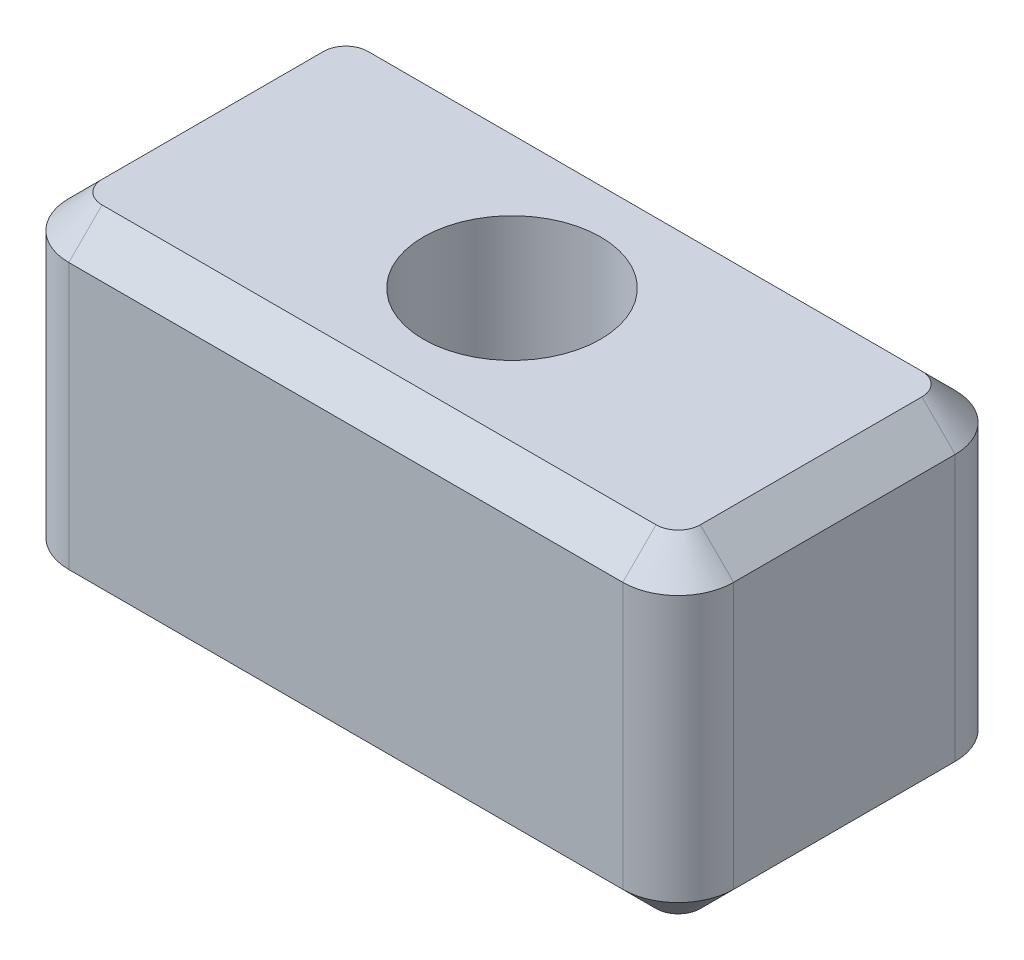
ISO-10303-21;
HEADER;
FILE_DESCRIPTION(('STEP AP214'),'2;1');
FILE_NAME('part.step','',(''),(''),'','','');
FILE_SCHEMA(('AUTOMOTIVE_DESIGN { 1 0 10303 214 1 1 1 1 }'));
ENDSEC;
DATA;
#1=APPLICATION_CONTEXT('core data for automotive mechanical design processes');
#2=APPLICATION_PROTOCOL_DEFINITION('international standard','automotive_design',2000,#1);
#3=PRODUCT_CONTEXT('',#1,'mechanical');
#4=PRODUCT('Part','Part','',(#3));
#5=PRODUCT_RELATED_PRODUCT_CATEGORY('part','',(#4));
#6=PRODUCT_DEFINITION_FORMATION('','',#4);
#7=PRODUCT_DEFINITION_CONTEXT('part definition',#1,'design');
#8=PRODUCT_DEFINITION('design','',#6,#7);
#9=PRODUCT_DEFINITION_SHAPE('','',#8);
#10=(LENGTH_UNIT() NAMED_UNIT(*) SI_UNIT(.MILLI.,.METRE.));
#11=(NAMED_UNIT(*) PLANE_ANGLE_UNIT() SI_UNIT($,.RADIAN.));
#12=(NAMED_UNIT(*) SI_UNIT($,.STERADIAN.) SOLID_ANGLE_UNIT());
#13=UNCERTAINTY_MEASURE_WITH_UNIT(LENGTH_MEASURE(1.E-05),#10,'distance_accuracy_value','');
#14=(GEOMETRIC_REPRESENTATION_CONTEXT(3) GLOBAL_UNCERTAINTY_ASSIGNED_CONTEXT((#13)) GLOBAL_UNIT_ASSIGNED_CONTEXT((#10,
#11,#12)) REPRESENTATION_CONTEXT('',''));
#15=CARTESIAN_POINT('',(0.,0.,0.));
#16=DIRECTION('',(0.,0.,1.));
#17=DIRECTION('',(1.,0.,0.));
#18=AXIS2_PLACEMENT_3D('',#15,#16,#17);
#19=CARTESIAN_POINT('',(53.,-5.4,0.15));
#20=DIRECTION('',(-1.,0.,0.));
#21=DIRECTION('',(0.,0.,1.));
#22=AXIS2_PLACEMENT_3D('',#19,#20,#21);
#23=PLANE('',#22);
#24=DIRECTION('',(0.,1.,0.));
#25=VECTOR('',#24,1.);
#26=CARTESIAN_POINT('',(53.,-5.4,2.65));
#27=LINE('',#26,#25);
#28=CARTESIAN_POINT('',(53.,-5.1,2.65));
#29=VERTEX_POINT('',#28);
#30=CARTESIAN_POINT('',(53.,-2.7,2.65));
#31=VERTEX_POINT('',#30);
#32=EDGE_CURVE('E320',#29,#31,#27,.T.);
#33=ORIENTED_EDGE('',*,*,#32,.T.);
#34=DIRECTION('',(0.,0.,-1.));
#35=VECTOR('',#34,1.);
#36=CARTESIAN_POINT('',(53.,-2.7,0.15));
#37=LINE('',#36,#35);
#38=CARTESIAN_POINT('',(53.,-2.7,0.65));
#39=VERTEX_POINT('',#38);
#40=EDGE_CURVE('E293',#31,#39,#37,.T.);
#41=ORIENTED_EDGE('',*,*,#40,.T.);
#42=DIRECTION('',(0.,1.,0.));
#43=VECTOR('',#42,1.);
#44=CARTESIAN_POINT('',(53.,-5.4,0.65));
#45=LINE('',#44,#43);
#46=CARTESIAN_POINT('',(53.,-5.1,0.65));
#47=VERTEX_POINT('',#46);
#48=EDGE_CURVE('E318',#39,#47,#45,.F.);
#49=ORIENTED_EDGE('',*,*,#48,.T.);
#50=DIRECTION('',(0.,0.,1.));
#51=VECTOR('',#50,1.);
#52=CARTESIAN_POINT('',(53.,-5.1,2.65));
#53=LINE('',#52,#51);
#54=EDGE_CURVE('E296',#47,#29,#53,.T.);
#55=ORIENTED_EDGE('',*,*,#54,.T.);
#56=EDGE_LOOP('',(#33,#41,#49,#55));
#57=FACE_BOUND('',#56,.T.);
#58=ADVANCED_FACE('F37',(#57),#23,.T.);
#59=CARTESIAN_POINT('',(53.,-5.4,0.15));
#60=DIRECTION('',(0.,0.,-1.));
#61=DIRECTION('',(-1.,0.,0.));
#62=AXIS2_PLACEMENT_3D('',#59,#60,#61);
#63=PLANE('',#62);
#64=DIRECTION('',(0.,1.,0.));
#65=VECTOR('',#64,1.);
#66=CARTESIAN_POINT('',(53.5,-5.4,0.15));
#67=LINE('',#66,#65);
#68=CARTESIAN_POINT('',(53.5,-5.1,0.15));
#69=VERTEX_POINT('',#68);
#70=CARTESIAN_POINT('',(53.5,-2.7,0.15));
#71=VERTEX_POINT('',#70);
#72=EDGE_CURVE('E323',#69,#71,#67,.T.);
#73=ORIENTED_EDGE('',*,*,#72,.T.);
#74=DIRECTION('',(1.,0.,0.));
#75=VECTOR('',#74,1.);
#76=CARTESIAN_POINT('',(53.,-2.7,0.15));
#77=LINE('',#76,#75);
#78=CARTESIAN_POINT('',(58.5,-2.7,0.15));
#79=VERTEX_POINT('',#78);
#80=EDGE_CURVE('E242',#71,#79,#77,.T.);
#81=ORIENTED_EDGE('',*,*,#80,.T.);
#82=DIRECTION('',(0.,1.,0.));
#83=VECTOR('',#82,1.);
#84=CARTESIAN_POINT('',(58.5,-5.4,0.15));
#85=LINE('',#84,#83);
#86=CARTESIAN_POINT('',(58.5,-5.1,0.15));
#87=VERTEX_POINT('',#86);
#88=EDGE_CURVE('E326',#79,#87,#85,.F.);
#89=ORIENTED_EDGE('',*,*,#88,.T.);
#90=DIRECTION('',(-1.,0.,0.));
#91=VECTOR('',#90,1.);
#92=CARTESIAN_POINT('',(53.5,-5.1,0.15));
#93=LINE('',#92,#91);
#94=EDGE_CURVE('E239',#87,#69,#93,.T.);
#95=ORIENTED_EDGE('',*,*,#94,.T.);
#96=EDGE_LOOP('',(#73,#81,#89,#95));
#97=FACE_BOUND('',#96,.T.);
#98=ADVANCED_FACE('F352',(#97),#63,.T.);
#99=CARTESIAN_POINT('',(59.,-5.4,0.15));
#100=DIRECTION('',(1.,0.,0.));
#101=DIRECTION('',(0.,0.,-1.));
#102=AXIS2_PLACEMENT_3D('',#99,#100,#101);
#103=PLANE('',#102);
#104=DIRECTION('',(0.,1.,0.));
#105=VECTOR('',#104,1.);
#106=CARTESIAN_POINT('',(59.,-5.4,0.65));
#107=LINE('',#106,#105);
#108=CARTESIAN_POINT('',(59.,-5.1,0.65));
#109=VERTEX_POINT('',#108);
#110=CARTESIAN_POINT('',(59.,-2.7,0.65));
#111=VERTEX_POINT('',#110);
#112=EDGE_CURVE('E312',#109,#111,#107,.T.);
#113=ORIENTED_EDGE('',*,*,#112,.T.);
#114=DIRECTION('',(0.,0.,1.));
#115=VECTOR('',#114,1.);
#116=CARTESIAN_POINT('',(59.,-2.7,0.15));
#117=LINE('',#116,#115);
#118=CARTESIAN_POINT('',(59.,-2.7,2.65));
#119=VERTEX_POINT('',#118);
#120=EDGE_CURVE('E258',#111,#119,#117,.T.);
#121=ORIENTED_EDGE('',*,*,#120,.T.);
#122=DIRECTION('',(0.,1.,0.));
#123=VECTOR('',#122,1.);
#124=CARTESIAN_POINT('',(59.,-5.4,2.65));
#125=LINE('',#124,#123);
#126=CARTESIAN_POINT('',(59.,-5.1,2.65));
#127=VERTEX_POINT('',#126);
#128=EDGE_CURVE('E315',#119,#127,#125,.F.);
#129=ORIENTED_EDGE('',*,*,#128,.T.);
#130=DIRECTION('',(0.,0.,-1.));
#131=VECTOR('',#130,1.);
#132=CARTESIAN_POINT('',(59.,-5.1,0.65));
#133=LINE('',#132,#131);
#134=EDGE_CURVE('E256',#127,#109,#133,.T.);
#135=ORIENTED_EDGE('',*,*,#134,.T.);
#136=EDGE_LOOP('',(#113,#121,#129,#135));
#137=FACE_BOUND('',#136,.T.);
#138=ADVANCED_FACE('F348',(#137),#103,.T.);
#139=CARTESIAN_POINT('',(53.,-5.4,3.15));
#140=DIRECTION('',(0.,0.,1.));
#141=DIRECTION('',(1.,0.,0.));
#142=AXIS2_PLACEMENT_3D('',#139,#140,#141);
#143=PLANE('',#142);
#144=DIRECTION('',(0.,1.,0.));
#145=VECTOR('',#144,1.);
#146=CARTESIAN_POINT('',(58.5,-5.4,3.15));
#147=LINE('',#146,#145);
#148=CARTESIAN_POINT('',(58.5,-5.1,3.15));
#149=VERTEX_POINT('',#148);
#150=CARTESIAN_POINT('',(58.5,-2.7,3.15));
#151=VERTEX_POINT('',#150);
#152=EDGE_CURVE('E310',#149,#151,#147,.T.);
#153=ORIENTED_EDGE('',*,*,#152,.T.);
#154=DIRECTION('',(-1.,0.,0.));
#155=VECTOR('',#154,1.);
#156=CARTESIAN_POINT('',(53.,-2.7,3.15));
#157=LINE('',#156,#155);
#158=CARTESIAN_POINT('',(53.5,-2.7,3.15));
#159=VERTEX_POINT('',#158);
#160=EDGE_CURVE('E233',#151,#159,#157,.T.);
#161=ORIENTED_EDGE('',*,*,#160,.T.);
#162=DIRECTION('',(0.,1.,0.));
#163=VECTOR('',#162,1.);
#164=CARTESIAN_POINT('',(53.5,-5.4,3.15));
#165=LINE('',#164,#163);
#166=CARTESIAN_POINT('',(53.5,-5.1,3.15));
#167=VERTEX_POINT('',#166);
#168=EDGE_CURVE('E175',#159,#167,#165,.F.);
#169=ORIENTED_EDGE('',*,*,#168,.T.);
#170=DIRECTION('',(1.,0.,0.));
#171=VECTOR('',#170,1.);
#172=CARTESIAN_POINT('',(58.5,-5.1,3.15));
#173=LINE('',#172,#171);
#174=EDGE_CURVE('E240',#167,#149,#173,.T.);
#175=ORIENTED_EDGE('',*,*,#174,.T.);
#176=EDGE_LOOP('',(#153,#161,#169,#175));
#177=FACE_BOUND('',#176,.T.);
#178=ADVANCED_FACE('F340',(#177),#143,.T.);
#179=CARTESIAN_POINT('',(0.,-5.4,0.));
#180=DIRECTION('',(0.,1.,0.));
#181=DIRECTION('',(0.,0.,1.));
#182=AXIS2_PLACEMENT_3D('',#179,#180,#181);
#183=PLANE('',#182);
#184=CARTESIAN_POINT('',(53.5,-5.4,2.65));
#185=DIRECTION('',(0.,1.,0.));
#186=DIRECTION('',(0.,0.,1.));
#187=AXIS2_PLACEMENT_3D('',#184,#185,#186);
#188=CIRCLE('',#187,0.199999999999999);
#189=CARTESIAN_POINT('',(53.5,-5.4,2.85));
#190=VERTEX_POINT('',#189);
#191=CARTESIAN_POINT('',(53.3,-5.4,2.65));
#192=VERTEX_POINT('',#191);
#193=EDGE_CURVE('E46',#190,#192,#188,.F.);
#194=ORIENTED_EDGE('',*,*,#193,.T.);
#195=DIRECTION('',(0.,0.,-1.));
#196=VECTOR('',#195,1.);
#197=CARTESIAN_POINT('',(53.3,-5.4,0.65));
#198=LINE('',#197,#196);
#199=CARTESIAN_POINT('',(53.3,-5.4,0.65));
#200=VERTEX_POINT('',#199);
#201=EDGE_CURVE('E11',#192,#200,#198,.T.);
#202=ORIENTED_EDGE('',*,*,#201,.T.);
#203=CARTESIAN_POINT('',(53.5,-5.4,0.65));
#204=DIRECTION('',(0.,1.,0.));
#205=DIRECTION('',(0.,0.,1.));
#206=AXIS2_PLACEMENT_3D('',#203,#204,#205);
#207=CIRCLE('',#206,0.199999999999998);
#208=CARTESIAN_POINT('',(53.5,-5.4,0.450000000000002));
#209=VERTEX_POINT('',#208);
#210=EDGE_CURVE('E270',#200,#209,#207,.F.);
#211=ORIENTED_EDGE('',*,*,#210,.T.);
#212=DIRECTION('',(1.,0.,0.));
#213=VECTOR('',#212,1.);
#214=CARTESIAN_POINT('',(58.5,-5.4,0.450000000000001));
#215=LINE('',#214,#213);
#216=CARTESIAN_POINT('',(58.5,-5.4,0.450000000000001));
#217=VERTEX_POINT('',#216);
#218=EDGE_CURVE('E266',#209,#217,#215,.T.);
#219=ORIENTED_EDGE('',*,*,#218,.T.);
#220=CARTESIAN_POINT('',(58.5,-5.4,0.65));
#221=DIRECTION('',(0.,1.,0.));
#222=DIRECTION('',(0.,0.,1.));
#223=AXIS2_PLACEMENT_3D('',#220,#221,#222);
#224=CIRCLE('',#223,0.199999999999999);
#225=CARTESIAN_POINT('',(58.7,-5.4,0.65));
#226=VERTEX_POINT('',#225);
#227=EDGE_CURVE('E262',#217,#226,#224,.F.);
#228=ORIENTED_EDGE('',*,*,#227,.T.);
#229=DIRECTION('',(0.,0.,1.));
#230=VECTOR('',#229,1.);
#231=CARTESIAN_POINT('',(58.7,-5.4,2.65));
#232=LINE('',#231,#230);
#233=CARTESIAN_POINT('',(58.7,-5.4,2.65));
#234=VERTEX_POINT('',#233);
#235=EDGE_CURVE('E260',#226,#234,#232,.T.);
#236=ORIENTED_EDGE('',*,*,#235,.T.);
#237=CARTESIAN_POINT('',(58.5,-5.4,2.65));
#238=DIRECTION('',(0.,1.,0.));
#239=DIRECTION('',(0.,0.,1.));
#240=AXIS2_PLACEMENT_3D('',#237,#238,#239);
#241=CIRCLE('',#240,0.199999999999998);
#242=CARTESIAN_POINT('',(58.5,-5.4,2.85));
#243=VERTEX_POINT('',#242);
#244=EDGE_CURVE('E264',#234,#243,#241,.F.);
#245=ORIENTED_EDGE('',*,*,#244,.T.);
#246=DIRECTION('',(-1.,0.,0.));
#247=VECTOR('',#246,1.);
#248=CARTESIAN_POINT('',(53.5,-5.4,2.85));
#249=LINE('',#248,#247);
#250=EDGE_CURVE('E268',#243,#190,#249,.T.);
#251=ORIENTED_EDGE('',*,*,#250,.T.);
#252=EDGE_LOOP('',(#194,#202,#211,#219,#228,#236,#245,#251));
#253=FACE_BOUND('',#252,.T.);
#254=CARTESIAN_POINT('',(56.,-5.4,1.65));
#255=DIRECTION('',(0.,-1.,0.));
#256=DIRECTION('',(0.,0.,-1.));
#257=AXIS2_PLACEMENT_3D('',#254,#255,#256);
#258=CIRCLE('',#257,1.025);
#259=CARTESIAN_POINT('',(56.,-5.4,0.625000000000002));
#260=VERTEX_POINT('',#259);
#261=EDGE_CURVE('E181',#260,#260,#258,.T.);
#262=ORIENTED_EDGE('',*,*,#261,.F.);
#263=EDGE_LOOP('',(#262));
#264=FACE_BOUND('',#263,.T.);
#265=ADVANCED_FACE('F272',(#253,#264),#183,.F.);
#266=CARTESIAN_POINT('',(0.,-2.4,0.));
#267=DIRECTION('',(0.,1.,0.));
#268=DIRECTION('',(0.,0.,1.));
#269=AXIS2_PLACEMENT_3D('',#266,#267,#268);
#270=PLANE('',#269);
#271=CARTESIAN_POINT('',(53.5,-2.4,0.65));
#272=DIRECTION('',(0.,1.,0.));
#273=DIRECTION('',(0.,0.,1.));
#274=AXIS2_PLACEMENT_3D('',#271,#272,#273);
#275=CIRCLE('',#274,0.199999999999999);
#276=CARTESIAN_POINT('',(53.5,-2.4,0.450000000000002));
#277=VERTEX_POINT('',#276);
#278=CARTESIAN_POINT('',(53.3,-2.4,0.65));
#279=VERTEX_POINT('',#278);
#280=EDGE_CURVE('E304',#277,#279,#275,.T.);
#281=ORIENTED_EDGE('',*,*,#280,.T.);
#282=DIRECTION('',(0.,0.,1.));
#283=VECTOR('',#282,1.);
#284=CARTESIAN_POINT('',(53.3,-2.4,0.));
#285=LINE('',#284,#283);
#286=CARTESIAN_POINT('',(53.3,-2.4,2.65));
#287=VERTEX_POINT('',#286);
#288=EDGE_CURVE('E299',#279,#287,#285,.T.);
#289=ORIENTED_EDGE('',*,*,#288,.T.);
#290=CARTESIAN_POINT('',(53.5,-2.4,2.65));
#291=DIRECTION('',(0.,1.,0.));
#292=DIRECTION('',(0.,0.,1.));
#293=AXIS2_PLACEMENT_3D('',#290,#291,#292);
#294=CIRCLE('',#293,0.199999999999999);
#295=CARTESIAN_POINT('',(53.5,-2.4,2.85));
#296=VERTEX_POINT('',#295);
#297=EDGE_CURVE('E302',#287,#296,#294,.T.);
#298=ORIENTED_EDGE('',*,*,#297,.T.);
#299=DIRECTION('',(1.,0.,0.));
#300=VECTOR('',#299,1.);
#301=CARTESIAN_POINT('',(0.,-2.4,2.85));
#302=LINE('',#301,#300);
#303=CARTESIAN_POINT('',(58.5,-2.4,2.85));
#304=VERTEX_POINT('',#303);
#305=EDGE_CURVE('E158',#296,#304,#302,.T.);
#306=ORIENTED_EDGE('',*,*,#305,.T.);
#307=CARTESIAN_POINT('',(58.5,-2.4,2.65));
#308=DIRECTION('',(0.,1.,0.));
#309=DIRECTION('',(0.,0.,1.));
#310=AXIS2_PLACEMENT_3D('',#307,#308,#309);
#311=CIRCLE('',#310,0.199999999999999);
#312=CARTESIAN_POINT('',(58.7,-2.4,2.65));
#313=VERTEX_POINT('',#312);
#314=EDGE_CURVE('E151',#304,#313,#311,.T.);
#315=ORIENTED_EDGE('',*,*,#314,.T.);
#316=DIRECTION('',(0.,0.,-1.));
#317=VECTOR('',#316,1.);
#318=CARTESIAN_POINT('',(58.7,-2.4,0.));
#319=LINE('',#318,#317);
#320=CARTESIAN_POINT('',(58.7,-2.4,0.65));
#321=VERTEX_POINT('',#320);
#322=EDGE_CURVE('E155',#313,#321,#319,.T.);
#323=ORIENTED_EDGE('',*,*,#322,.T.);
#324=CARTESIAN_POINT('',(58.5,-2.4,0.65));
#325=DIRECTION('',(0.,1.,0.));
#326=DIRECTION('',(0.,0.,1.));
#327=AXIS2_PLACEMENT_3D('',#324,#325,#326);
#328=CIRCLE('',#327,0.199999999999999);
#329=CARTESIAN_POINT('',(58.5,-2.4,0.450000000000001));
#330=VERTEX_POINT('',#329);
#331=EDGE_CURVE('E164',#321,#330,#328,.T.);
#332=ORIENTED_EDGE('',*,*,#331,.T.);
#333=DIRECTION('',(-1.,0.,0.));
#334=VECTOR('',#333,1.);
#335=CARTESIAN_POINT('',(0.,-2.4,0.450000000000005));
#336=LINE('',#335,#334);
#337=EDGE_CURVE('E163',#330,#277,#336,.T.);
#338=ORIENTED_EDGE('',*,*,#337,.T.);
#339=EDGE_LOOP('',(#281,#289,#298,#306,#315,#323,#332,#338));
#340=FACE_BOUND('',#339,.T.);
#341=CARTESIAN_POINT('',(56.,-2.39999999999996,1.65));
#342=DIRECTION('',(0.,-1.,0.));
#343=DIRECTION('',(0.,0.,-1.));
#344=AXIS2_PLACEMENT_3D('',#341,#342,#343);
#345=CIRCLE('',#344,0.800000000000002);
#346=CARTESIAN_POINT('',(56.,-2.39999999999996,0.849999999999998));
#347=VERTEX_POINT('',#346);
#348=EDGE_CURVE('E329',#347,#347,#345,.T.);
#349=ORIENTED_EDGE('',*,*,#348,.T.);
#350=EDGE_LOOP('',(#349));
#351=FACE_BOUND('',#350,.T.);
#352=ADVANCED_FACE('F153',(#340,#351),#270,.T.);
#353=CARTESIAN_POINT('',(56.,-5.4,1.65));
#354=DIRECTION('',(0.,-1.,0.));
#355=DIRECTION('',(0.,0.,-1.));
#356=AXIS2_PLACEMENT_3D('',#353,#354,#355);
#357=CYLINDRICAL_SURFACE('',#356,0.800000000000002);
#358=ORIENTED_EDGE('',*,*,#348,.F.);
#359=EDGE_LOOP('',(#358));
#360=FACE_BOUND('',#359,.T.);
#361=CARTESIAN_POINT('',(56.,-5.175,1.65));
#362=DIRECTION('',(0.,-1.,0.));
#363=DIRECTION('',(0.,0.,-1.));
#364=AXIS2_PLACEMENT_3D('',#361,#362,#363);
#365=CIRCLE('',#364,0.800000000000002);
#366=CARTESIAN_POINT('',(56.,-5.175,0.849999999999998));
#367=VERTEX_POINT('',#366);
#368=EDGE_CURVE('E332',#367,#367,#365,.T.);
#369=ORIENTED_EDGE('',*,*,#368,.T.);
#370=EDGE_LOOP('',(#369));
#371=FACE_BOUND('',#370,.T.);
#372=ADVANCED_FACE('F346',(#360,#371),#357,.F.);
#373=CARTESIAN_POINT('',(56.,-5.4,1.65));
#374=DIRECTION('',(0.,-1.,0.));
#375=DIRECTION('',(0.,0.,-1.));
#376=AXIS2_PLACEMENT_3D('',#373,#374,#375);
#377=CONICAL_SURFACE('',#376,1.025,0.785398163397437);
#378=ORIENTED_EDGE('',*,*,#368,.F.);
#379=EDGE_LOOP('',(#378));
#380=FACE_BOUND('',#379,.T.);
#381=ORIENTED_EDGE('',*,*,#261,.T.);
#382=EDGE_LOOP('',(#381));
#383=FACE_BOUND('',#382,.T.);
#384=ADVANCED_FACE('F338',(#380,#383),#377,.F.);
#385=CARTESIAN_POINT('',(53.5,-5.4,0.65));
#386=DIRECTION('',(0.,1.,0.));
#387=DIRECTION('',(0.,0.,1.));
#388=AXIS2_PLACEMENT_3D('',#385,#386,#387);
#389=CYLINDRICAL_SURFACE('',#388,0.5);
#390=ORIENTED_EDGE('',*,*,#48,.F.);
#391=CARTESIAN_POINT('',(53.5,-2.7,0.65));
#392=DIRECTION('',(0.,1.,0.));
#393=DIRECTION('',(0.,0.,1.));
#394=AXIS2_PLACEMENT_3D('',#391,#392,#393);
#395=CIRCLE('',#394,0.5);
#396=EDGE_CURVE('E244',#39,#71,#395,.F.);
#397=ORIENTED_EDGE('',*,*,#396,.T.);
#398=ORIENTED_EDGE('',*,*,#72,.F.);
#399=CARTESIAN_POINT('',(53.5,-5.1,0.65));
#400=DIRECTION('',(0.,1.,0.));
#401=DIRECTION('',(0.,0.,1.));
#402=AXIS2_PLACEMENT_3D('',#399,#400,#401);
#403=CIRCLE('',#402,0.5);
#404=EDGE_CURVE('E282',#69,#47,#403,.T.);
#405=ORIENTED_EDGE('',*,*,#404,.T.);
#406=EDGE_LOOP('',(#390,#397,#398,#405));
#407=FACE_BOUND('',#406,.T.);
#408=ADVANCED_FACE('F362',(#407),#389,.T.);
#409=CARTESIAN_POINT('',(58.5,-5.4,0.65));
#410=DIRECTION('',(0.,1.,0.));
#411=DIRECTION('',(0.,0.,1.));
#412=AXIS2_PLACEMENT_3D('',#409,#410,#411);
#413=CYLINDRICAL_SURFACE('',#412,0.5);
#414=ORIENTED_EDGE('',*,*,#88,.F.);
#415=CARTESIAN_POINT('',(58.5,-2.7,0.65));
#416=DIRECTION('',(0.,1.,0.));
#417=DIRECTION('',(0.,0.,1.));
#418=AXIS2_PLACEMENT_3D('',#415,#416,#417);
#419=CIRCLE('',#418,0.5);
#420=EDGE_CURVE('E254',#79,#111,#419,.F.);
#421=ORIENTED_EDGE('',*,*,#420,.T.);
#422=ORIENTED_EDGE('',*,*,#112,.F.);
#423=CARTESIAN_POINT('',(58.5,-5.1,0.65));
#424=DIRECTION('',(0.,1.,0.));
#425=DIRECTION('',(0.,0.,1.));
#426=AXIS2_PLACEMENT_3D('',#423,#424,#425);
#427=CIRCLE('',#426,0.5);
#428=EDGE_CURVE('E252',#109,#87,#427,.T.);
#429=ORIENTED_EDGE('',*,*,#428,.T.);
#430=EDGE_LOOP('',(#414,#421,#422,#429));
#431=FACE_BOUND('',#430,.T.);
#432=ADVANCED_FACE('F365',(#431),#413,.T.);
#433=CARTESIAN_POINT('',(53.5,-5.4,2.65));
#434=DIRECTION('',(0.,1.,0.));
#435=DIRECTION('',(0.,0.,1.));
#436=AXIS2_PLACEMENT_3D('',#433,#434,#435);
#437=CYLINDRICAL_SURFACE('',#436,0.5);
#438=ORIENTED_EDGE('',*,*,#168,.F.);
#439=CARTESIAN_POINT('',(53.5,-2.7,2.65));
#440=DIRECTION('',(0.,1.,0.));
#441=DIRECTION('',(0.,0.,1.));
#442=AXIS2_PLACEMENT_3D('',#439,#440,#441);
#443=CIRCLE('',#442,0.5);
#444=EDGE_CURVE('E287',#159,#31,#443,.F.);
#445=ORIENTED_EDGE('',*,*,#444,.T.);
#446=ORIENTED_EDGE('',*,*,#32,.F.);
#447=CARTESIAN_POINT('',(53.5,-5.1,2.65));
#448=DIRECTION('',(0.,1.,0.));
#449=DIRECTION('',(0.,0.,1.));
#450=AXIS2_PLACEMENT_3D('',#447,#448,#449);
#451=CIRCLE('',#450,0.5);
#452=EDGE_CURVE('E289',#29,#167,#451,.T.);
#453=ORIENTED_EDGE('',*,*,#452,.T.);
#454=EDGE_LOOP('',(#438,#445,#446,#453));
#455=FACE_BOUND('',#454,.T.);
#456=ADVANCED_FACE('F368',(#455),#437,.T.);
#457=CARTESIAN_POINT('',(58.5,-5.4,2.65));
#458=DIRECTION('',(0.,1.,0.));
#459=DIRECTION('',(0.,0.,1.));
#460=AXIS2_PLACEMENT_3D('',#457,#458,#459);
#461=CYLINDRICAL_SURFACE('',#460,0.5);
#462=ORIENTED_EDGE('',*,*,#128,.F.);
#463=CARTESIAN_POINT('',(58.5,-2.7,2.65));
#464=DIRECTION('',(0.,1.,0.));
#465=DIRECTION('',(0.,0.,1.));
#466=AXIS2_PLACEMENT_3D('',#463,#464,#465);
#467=CIRCLE('',#466,0.5);
#468=EDGE_CURVE('E178',#119,#151,#467,.F.);
#469=ORIENTED_EDGE('',*,*,#468,.T.);
#470=ORIENTED_EDGE('',*,*,#152,.F.);
#471=CARTESIAN_POINT('',(58.5,-5.1,2.65));
#472=DIRECTION('',(0.,1.,0.));
#473=DIRECTION('',(0.,0.,1.));
#474=AXIS2_PLACEMENT_3D('',#471,#472,#473);
#475=CIRCLE('',#474,0.5);
#476=EDGE_CURVE('E249',#149,#127,#475,.T.);
#477=ORIENTED_EDGE('',*,*,#476,.T.);
#478=EDGE_LOOP('',(#462,#469,#470,#477));
#479=FACE_BOUND('',#478,.T.);
#480=ADVANCED_FACE('F372',(#479),#461,.T.);
#481=CARTESIAN_POINT('',(58.7,-2.4,0.));
#482=DIRECTION('',(-0.707106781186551,-0.707106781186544,0.));
#483=DIRECTION('',(0.,0.,-1.));
#484=AXIS2_PLACEMENT_3D('',#481,#482,#483);
#485=PLANE('',#484);
#486=DIRECTION('',(-0.707106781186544,0.707106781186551,0.));
#487=VECTOR('',#486,1.);
#488=CARTESIAN_POINT('',(59.,-2.7,2.65));
#489=LINE('',#488,#487);
#490=EDGE_CURVE('E170',#119,#313,#489,.T.);
#491=ORIENTED_EDGE('',*,*,#490,.F.);
#492=ORIENTED_EDGE('',*,*,#120,.F.);
#493=DIRECTION('',(0.707106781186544,-0.707106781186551,0.));
#494=VECTOR('',#493,1.);
#495=CARTESIAN_POINT('',(58.7,-2.4,0.65));
#496=LINE('',#495,#494);
#497=EDGE_CURVE('E173',#321,#111,#496,.T.);
#498=ORIENTED_EDGE('',*,*,#497,.F.);
#499=ORIENTED_EDGE('',*,*,#322,.F.);
#500=EDGE_LOOP('',(#491,#492,#498,#499));
#501=FACE_BOUND('',#500,.T.);
#502=ADVANCED_FACE('F168',(#501),#485,.F.);
#503=CARTESIAN_POINT('',(58.5,-2.4,0.65));
#504=DIRECTION('',(0.,-1.,0.));
#505=DIRECTION('',(0.,0.,-1.));
#506=AXIS2_PLACEMENT_3D('',#503,#504,#505);
#507=CONICAL_SURFACE('',#506,0.199999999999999,0.785398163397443);
#508=ORIENTED_EDGE('',*,*,#497,.T.);
#509=ORIENTED_EDGE('',*,*,#420,.F.);
#510=DIRECTION('',(0.,-0.707106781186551,-0.707106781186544));
#511=VECTOR('',#510,1.);
#512=CARTESIAN_POINT('',(58.5,-2.4,0.450000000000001));
#513=LINE('',#512,#511);
#514=EDGE_CURVE('E179',#330,#79,#513,.T.);
#515=ORIENTED_EDGE('',*,*,#514,.F.);
#516=ORIENTED_EDGE('',*,*,#331,.F.);
#517=EDGE_LOOP('',(#508,#509,#515,#516));
#518=FACE_BOUND('',#517,.T.);
#519=ADVANCED_FACE('F396',(#518),#507,.T.);
#520=CARTESIAN_POINT('',(58.5,-2.4,2.65));
#521=DIRECTION('',(0.,-1.,0.));
#522=DIRECTION('',(0.,0.,-1.));
#523=AXIS2_PLACEMENT_3D('',#520,#521,#522);
#524=CONICAL_SURFACE('',#523,0.199999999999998,0.785398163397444);
#525=ORIENTED_EDGE('',*,*,#490,.T.);
#526=ORIENTED_EDGE('',*,*,#314,.F.);
#527=DIRECTION('',(0.,0.707106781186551,-0.707106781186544));
#528=VECTOR('',#527,1.);
#529=CARTESIAN_POINT('',(58.5,-2.7,3.15));
#530=LINE('',#529,#528);
#531=EDGE_CURVE('E184',#151,#304,#530,.T.);
#532=ORIENTED_EDGE('',*,*,#531,.F.);
#533=ORIENTED_EDGE('',*,*,#468,.F.);
#534=EDGE_LOOP('',(#525,#526,#532,#533));
#535=FACE_BOUND('',#534,.T.);
#536=ADVANCED_FACE('F177',(#535),#524,.T.);
#537=CARTESIAN_POINT('',(0.,-2.4,0.450000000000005));
#538=DIRECTION('',(0.,-0.707106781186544,0.707106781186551));
#539=DIRECTION('',(-1.,0.,0.));
#540=AXIS2_PLACEMENT_3D('',#537,#538,#539);
#541=PLANE('',#540);
#542=ORIENTED_EDGE('',*,*,#514,.T.);
#543=ORIENTED_EDGE('',*,*,#80,.F.);
#544=DIRECTION('',(0.,-0.70710678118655,-0.707106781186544));
#545=VECTOR('',#544,1.);
#546=CARTESIAN_POINT('',(53.5,-2.4,0.450000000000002));
#547=LINE('',#546,#545);
#548=EDGE_CURVE('E227',#277,#71,#547,.T.);
#549=ORIENTED_EDGE('',*,*,#548,.F.);
#550=ORIENTED_EDGE('',*,*,#337,.F.);
#551=EDGE_LOOP('',(#542,#543,#549,#550));
#552=FACE_BOUND('',#551,.T.);
#553=ADVANCED_FACE('F390',(#552),#541,.F.);
#554=CARTESIAN_POINT('',(0.,-2.4,2.85));
#555=DIRECTION('',(0.,-0.707106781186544,-0.707106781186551));
#556=DIRECTION('',(1.,0.,0.));
#557=AXIS2_PLACEMENT_3D('',#554,#555,#556);
#558=PLANE('',#557);
#559=ORIENTED_EDGE('',*,*,#531,.T.);
#560=ORIENTED_EDGE('',*,*,#305,.F.);
#561=DIRECTION('',(0.,0.707106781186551,-0.707106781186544));
#562=VECTOR('',#561,1.);
#563=CARTESIAN_POINT('',(53.5,-2.7,3.15));
#564=LINE('',#563,#562);
#565=EDGE_CURVE('E221',#159,#296,#564,.T.);
#566=ORIENTED_EDGE('',*,*,#565,.F.);
#567=ORIENTED_EDGE('',*,*,#160,.F.);
#568=EDGE_LOOP('',(#559,#560,#566,#567));
#569=FACE_BOUND('',#568,.T.);
#570=ADVANCED_FACE('F231',(#569),#558,.F.);
#571=CARTESIAN_POINT('',(53.5,-2.4,0.65));
#572=DIRECTION('',(0.,-1.,0.));
#573=DIRECTION('',(0.,0.,-1.));
#574=AXIS2_PLACEMENT_3D('',#571,#572,#573);
#575=CONICAL_SURFACE('',#574,0.199999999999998,0.785398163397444);
#576=ORIENTED_EDGE('',*,*,#548,.T.);
#577=ORIENTED_EDGE('',*,*,#396,.F.);
#578=DIRECTION('',(-0.707106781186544,-0.707106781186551,0.));
#579=VECTOR('',#578,1.);
#580=CARTESIAN_POINT('',(53.3,-2.4,0.65));
#581=LINE('',#580,#579);
#582=EDGE_CURVE('E214',#279,#39,#581,.T.);
#583=ORIENTED_EDGE('',*,*,#582,.F.);
#584=ORIENTED_EDGE('',*,*,#280,.F.);
#585=EDGE_LOOP('',(#576,#577,#583,#584));
#586=FACE_BOUND('',#585,.T.);
#587=ADVANCED_FACE('F383',(#586),#575,.T.);
#588=CARTESIAN_POINT('',(53.5,-2.4,2.65));
#589=DIRECTION('',(0.,-1.,0.));
#590=DIRECTION('',(0.,0.,-1.));
#591=AXIS2_PLACEMENT_3D('',#588,#589,#590);
#592=CONICAL_SURFACE('',#591,0.199999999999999,0.785398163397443);
#593=ORIENTED_EDGE('',*,*,#565,.T.);
#594=ORIENTED_EDGE('',*,*,#297,.F.);
#595=DIRECTION('',(0.707106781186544,0.707106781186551,0.));
#596=VECTOR('',#595,1.);
#597=CARTESIAN_POINT('',(53.,-2.7,2.65));
#598=LINE('',#597,#596);
#599=EDGE_CURVE('E209',#31,#287,#598,.T.);
#600=ORIENTED_EDGE('',*,*,#599,.F.);
#601=ORIENTED_EDGE('',*,*,#444,.F.);
#602=EDGE_LOOP('',(#593,#594,#600,#601));
#603=FACE_BOUND('',#602,.T.);
#604=ADVANCED_FACE('F380',(#603),#592,.T.);
#605=CARTESIAN_POINT('',(53.3,-2.4,0.));
#606=DIRECTION('',(0.707106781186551,-0.707106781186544,0.));
#607=DIRECTION('',(0.,0.,1.));
#608=AXIS2_PLACEMENT_3D('',#605,#606,#607);
#609=PLANE('',#608);
#610=ORIENTED_EDGE('',*,*,#582,.T.);
#611=ORIENTED_EDGE('',*,*,#40,.F.);
#612=ORIENTED_EDGE('',*,*,#599,.T.);
#613=ORIENTED_EDGE('',*,*,#288,.F.);
#614=EDGE_LOOP('',(#610,#611,#612,#613));
#615=FACE_BOUND('',#614,.T.);
#616=ADVANCED_FACE('F377',(#615),#609,.F.);
#617=CARTESIAN_POINT('',(59.,-5.1,0.15));
#618=DIRECTION('',(0.707106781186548,-0.707106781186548,0.));
#619=DIRECTION('',(0.,0.,1.));
#620=AXIS2_PLACEMENT_3D('',#617,#618,#619);
#621=PLANE('',#620);
#622=DIRECTION('',(0.707106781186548,0.707106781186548,0.));
#623=VECTOR('',#622,1.);
#624=CARTESIAN_POINT('',(58.7,-5.4,2.65));
#625=LINE('',#624,#623);
#626=EDGE_CURVE('E202',#234,#127,#625,.T.);
#627=ORIENTED_EDGE('',*,*,#626,.F.);
#628=ORIENTED_EDGE('',*,*,#235,.F.);
#629=DIRECTION('',(-0.707106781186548,-0.707106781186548,0.));
#630=VECTOR('',#629,1.);
#631=CARTESIAN_POINT('',(59.,-5.1,0.65));
#632=LINE('',#631,#630);
#633=EDGE_CURVE('E41',#109,#226,#632,.T.);
#634=ORIENTED_EDGE('',*,*,#633,.F.);
#635=ORIENTED_EDGE('',*,*,#134,.F.);
#636=EDGE_LOOP('',(#627,#628,#634,#635));
#637=FACE_BOUND('',#636,.T.);
#638=ADVANCED_FACE('F39',(#637),#621,.T.);
#639=CARTESIAN_POINT('',(58.5,-5.4,0.65));
#640=DIRECTION('',(0.,1.,0.));
#641=DIRECTION('',(0.,0.,1.));
#642=AXIS2_PLACEMENT_3D('',#639,#640,#641);
#643=CONICAL_SURFACE('',#642,0.199999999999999,0.785398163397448);
#644=ORIENTED_EDGE('',*,*,#633,.T.);
#645=ORIENTED_EDGE('',*,*,#227,.F.);
#646=DIRECTION('',(0.,-0.707106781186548,0.707106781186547));
#647=VECTOR('',#646,1.);
#648=CARTESIAN_POINT('',(58.5,-5.1,0.15));
#649=LINE('',#648,#647);
#650=EDGE_CURVE('E200',#87,#217,#649,.T.);
#651=ORIENTED_EDGE('',*,*,#650,.F.);
#652=ORIENTED_EDGE('',*,*,#428,.F.);
#653=EDGE_LOOP('',(#644,#645,#651,#652));
#654=FACE_BOUND('',#653,.T.);
#655=ADVANCED_FACE('F419',(#654),#643,.T.);
#656=CARTESIAN_POINT('',(58.5,-5.4,2.65));
#657=DIRECTION('',(0.,1.,0.));
#658=DIRECTION('',(0.,0.,1.));
#659=AXIS2_PLACEMENT_3D('',#656,#657,#658);
#660=CONICAL_SURFACE('',#659,0.199999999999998,0.785398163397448);
#661=ORIENTED_EDGE('',*,*,#626,.T.);
#662=ORIENTED_EDGE('',*,*,#476,.F.);
#663=DIRECTION('',(0.,0.707106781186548,0.707106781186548));
#664=VECTOR('',#663,1.);
#665=CARTESIAN_POINT('',(58.5,-5.4,2.85));
#666=LINE('',#665,#664);
#667=EDGE_CURVE('E197',#243,#149,#666,.T.);
#668=ORIENTED_EDGE('',*,*,#667,.F.);
#669=ORIENTED_EDGE('',*,*,#244,.F.);
#670=EDGE_LOOP('',(#661,#662,#668,#669));
#671=FACE_BOUND('',#670,.T.);
#672=ADVANCED_FACE('F417',(#671),#660,.T.);
#673=CARTESIAN_POINT('',(53.,-5.1,0.15));
#674=DIRECTION('',(0.,-0.707106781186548,-0.707106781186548));
#675=DIRECTION('',(1.,0.,0.));
#676=AXIS2_PLACEMENT_3D('',#673,#674,#675);
#677=PLANE('',#676);
#678=ORIENTED_EDGE('',*,*,#650,.T.);
#679=ORIENTED_EDGE('',*,*,#218,.F.);
#680=DIRECTION('',(0.,-0.707106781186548,0.707106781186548));
#681=VECTOR('',#680,1.);
#682=CARTESIAN_POINT('',(53.5,-5.1,0.15));
#683=LINE('',#682,#681);
#684=EDGE_CURVE('E194',#69,#209,#683,.T.);
#685=ORIENTED_EDGE('',*,*,#684,.F.);
#686=ORIENTED_EDGE('',*,*,#94,.F.);
#687=EDGE_LOOP('',(#678,#679,#685,#686));
#688=FACE_BOUND('',#687,.T.);
#689=ADVANCED_FACE('F277',(#688),#677,.T.);
#690=CARTESIAN_POINT('',(53.,-5.1,3.15));
#691=DIRECTION('',(0.,-0.707106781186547,0.707106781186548));
#692=DIRECTION('',(-1.,0.,0.));
#693=AXIS2_PLACEMENT_3D('',#690,#691,#692);
#694=PLANE('',#693);
#695=ORIENTED_EDGE('',*,*,#667,.T.);
#696=ORIENTED_EDGE('',*,*,#174,.F.);
#697=DIRECTION('',(0.,0.707106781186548,0.707106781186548));
#698=VECTOR('',#697,1.);
#699=CARTESIAN_POINT('',(53.5,-5.4,2.85));
#700=LINE('',#699,#698);
#701=EDGE_CURVE('E191',#190,#167,#700,.T.);
#702=ORIENTED_EDGE('',*,*,#701,.F.);
#703=ORIENTED_EDGE('',*,*,#250,.F.);
#704=EDGE_LOOP('',(#695,#696,#702,#703));
#705=FACE_BOUND('',#704,.T.);
#706=ADVANCED_FACE('F411',(#705),#694,.T.);
#707=CARTESIAN_POINT('',(53.5,-5.4,0.65));
#708=DIRECTION('',(0.,1.,0.));
#709=DIRECTION('',(0.,0.,1.));
#710=AXIS2_PLACEMENT_3D('',#707,#708,#709);
#711=CONICAL_SURFACE('',#710,0.199999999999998,0.785398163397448);
#712=ORIENTED_EDGE('',*,*,#684,.T.);
#713=ORIENTED_EDGE('',*,*,#210,.F.);
#714=DIRECTION('',(0.707106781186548,-0.707106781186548,0.));
#715=VECTOR('',#714,1.);
#716=CARTESIAN_POINT('',(53.,-5.1,0.65));
#717=LINE('',#716,#715);
#718=EDGE_CURVE('E59',#47,#200,#717,.T.);
#719=ORIENTED_EDGE('',*,*,#718,.F.);
#720=ORIENTED_EDGE('',*,*,#404,.F.);
#721=EDGE_LOOP('',(#712,#713,#719,#720));
#722=FACE_BOUND('',#721,.T.);
#723=ADVANCED_FACE('F281',(#722),#711,.T.);
#724=CARTESIAN_POINT('',(53.5,-5.4,2.65));
#725=DIRECTION('',(0.,1.,0.));
#726=DIRECTION('',(0.,0.,1.));
#727=AXIS2_PLACEMENT_3D('',#724,#725,#726);
#728=CONICAL_SURFACE('',#727,0.199999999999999,0.785398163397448);
#729=ORIENTED_EDGE('',*,*,#701,.T.);
#730=ORIENTED_EDGE('',*,*,#452,.F.);
#731=DIRECTION('',(-0.707106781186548,0.707106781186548,0.));
#732=VECTOR('',#731,1.);
#733=CARTESIAN_POINT('',(53.3,-5.4,2.65));
#734=LINE('',#733,#732);
#735=EDGE_CURVE('E188',#192,#29,#734,.T.);
#736=ORIENTED_EDGE('',*,*,#735,.F.);
#737=ORIENTED_EDGE('',*,*,#193,.F.);
#738=EDGE_LOOP('',(#729,#730,#736,#737));
#739=FACE_BOUND('',#738,.T.);
#740=ADVANCED_FACE('F405',(#739),#728,.T.);
#741=CARTESIAN_POINT('',(53.,-5.1,0.15));
#742=DIRECTION('',(-0.707106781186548,-0.707106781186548,0.));
#743=DIRECTION('',(0.,0.,-1.));
#744=AXIS2_PLACEMENT_3D('',#741,#742,#743);
#745=PLANE('',#744);
#746=ORIENTED_EDGE('',*,*,#718,.T.);
#747=ORIENTED_EDGE('',*,*,#201,.F.);
#748=ORIENTED_EDGE('',*,*,#735,.T.);
#749=ORIENTED_EDGE('',*,*,#54,.F.);
#750=EDGE_LOOP('',(#746,#747,#748,#749));
#751=FACE_BOUND('',#750,.T.);
#752=ADVANCED_FACE('F402',(#751),#745,.T.);
#753=CLOSED_SHELL('',(#58,#98,#138,#178,#265,#352,#372,#384,#408,#432,#456,#480,#502,#519,#536,
#553,#570,#587,#604,#616,#638,#655,#672,#689,#706,#723,#740,#752));
#754=MANIFOLD_SOLID_BREP('B2',#753);
#755=ADVANCED_BREP_SHAPE_REPRESENTATION('',(#18,#754),#14);
#756=SHAPE_DEFINITION_REPRESENTATION(#9,#755);
ENDSEC;
END-ISO-10303-21;
